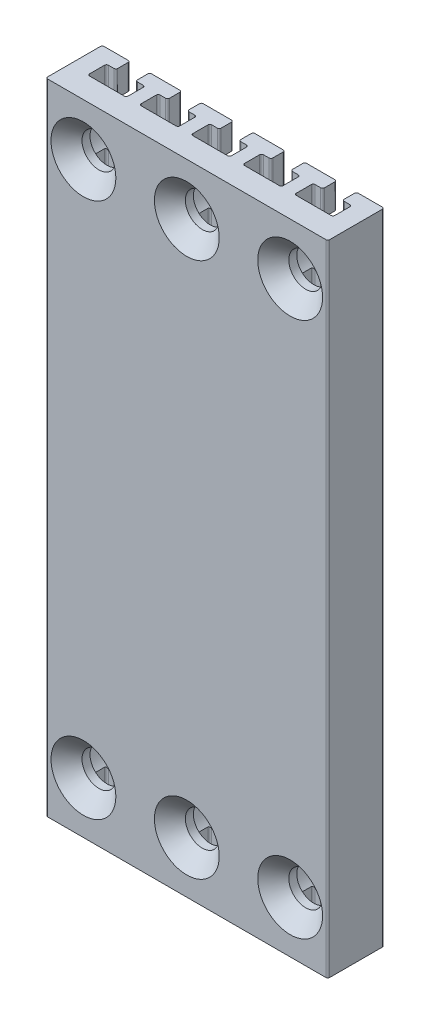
from build123d import *

# Parameters (mm, degrees)
BOSS_EXTRU_1_DEPTH                             = 68
CASSAGE_D_ANGLE_RAINURES_R                     = 0.2
CENTRAGE_RAPPELS_REACH                         = 71.893
ESQUISSE2_R                                    = 3
FRAISAGE_POUR_VIS_T_TE_FRAIS_E_M33_D           = 3.6
FRAISAGE_POUR_VIS_T_TE_FRAIS_E_M33_CSINK_D     = 6.9
FRAISAGE_POUR_VIS_T_TE_FRAIS_E_M33_CSINK_ANGLE = 90
R_P_TITION_LIN_AIRE1_COUNT                     = 3
R_P_TITION_LIN_AIRE1_PITCH                     = 11
R_P_TITION_LIN_AIRE1_COUNT_DIR2                = 2
R_P_TITION_LIN_AIRE1_PITCH_DIR2                = 57


with BuildPart() as part:
    # Esquisse1 → Boss.-Extru.1 (new body)
    with BuildSketch(Plane(origin=(0, 0, 0), x_dir=(1, 0, 0), z_dir=(0, 1, 0))):
        Polygon((-15, 6), (-12.05, 6), (-12.05, 4.5), (-13.05, 4.5), (-13.05, 2.5), (-8.95, 2.5), (-8.95, 4.5), (-9.95, 4.5), (-9.95, 6), (-6.55, 6), (-6.55, 4.5), (-7.55, 4.5), (-7.55, 2.5), (-3.45, 2.5), (-3.45, 4.5), (-4.45, 4.5), (-4.45, 6), (-1.05, 6), (-1.05, 4.5), (-2.05, 4.5), (-2.05, 2.5), (2.05, 2.5), (2.05, 4.5), (1.05, 4.5), (1.05, 6), (4.45, 6), (4.45, 4.5), (3.45, 4.5), (3.45, 2.5), (7.55, 2.5), (7.55, 4.5), (6.55, 4.5), (6.55, 6), (9.95, 6), (9.95, 4.5), (8.95, 4.5), (8.95, 2.5), (13.05, 2.5), (13.05, 4.5), (12.05, 4.5), (12.05, 6), (15, 6), (15, 0), (-15, 0), align=None)
    extrude(amount=BOSS_EXTRU_1_DEPTH)

    # Cassage d_angle rainures
    cassage_d_angle_rainures_edges = [part.edges().sort_by_distance(p)[0] for p in [
        (-15, 34, -6),
        (-12.05, 34, -6),
        (-12.05, 34, -4.5),
        (-13.05, 34, -4.5),
        (-13.05, 34, -2.5),
        (-8.95, 34, -2.5),
        (-8.95, 34, -4.5),
        (-9.95, 34, -4.5),
        (-9.95, 34, -6),
        (-6.55, 34, -6),
        (-6.55, 34, -4.5),
        (-7.55, 34, -4.5),
        (-7.55, 34, -2.5),
        (-3.45, 34, -2.5),
        (-3.45, 34, -4.5),
        (-4.45, 34, -4.5),
        (-4.45, 34, -6),
        (-1.05, 34, -6),
        (-1.05, 34, -4.5),
        (-2.05, 34, -4.5),
        (-2.05, 34, -2.5),
        (2.05, 34, -2.5),
        (2.05, 34, -4.5),
        (1.05, 34, -4.5),
        (1.05, 34, -6),
        (4.45, 34, -6),
        (4.45, 34, -4.5),
        (3.45, 34, -4.5),
        (3.45, 34, -2.5),
        (7.55, 34, -2.5),
        (7.55, 34, -4.5),
        (6.55, 34, -4.5),
        (6.55, 34, -6),
        (9.95, 34, -6),
        (9.95, 34, -4.5),
        (8.95, 34, -4.5),
        (8.95, 34, -2.5),
        (13.05, 34, -2.5),
        (13.05, 34, -4.5),
        (12.05, 34, -4.5),
        (12.05, 34, -6),
        (15, 34, -6),
        (15, 34, 0),
        (-15, 34, 0),
    ]]
    fillet(cassage_d_angle_rainures_edges, radius=CASSAGE_D_ANGLE_RAINURES_R)

    # centrage rappels: up to this face of the body (flat: up to its plane)
    centrage_rappels_end = Plane(part.part.faces().sort_by_distance((5.5, 34, -2.5))[0])
    # Esquisse2 → centrage rappels (cut, up to the picked face)
    with BuildSketch(Plane(origin=(0, 0, -6), x_dir=(-1, 0, 0), z_dir=(0, 0, -1)), mode=Mode.PRIVATE) as centrage_rappels_sk1:
        with Locations((-11, 62.5)):
            Circle(ESQUISSE2_R)
    centrage_rappels_tool1 = split(extrude(centrage_rappels_sk1.sketch, amount=-CENTRAGE_RAPPELS_REACH, mode=Mode.PRIVATE), bisect_by=centrage_rappels_end, keep=Keep.BOTH, mode=Mode.PRIVATE)
    # Esquisse2 → centrage rappels (cut, up to the picked face)
    with BuildSketch(Plane(origin=(0, 0, -6), x_dir=(-1, 0, 0), z_dir=(0, 0, -1)), mode=Mode.PRIVATE) as centrage_rappels_sk2:
        with Locations((0, 62.5)):
            Circle(ESQUISSE2_R)
    centrage_rappels_tool2 = split(extrude(centrage_rappels_sk2.sketch, amount=-CENTRAGE_RAPPELS_REACH, mode=Mode.PRIVATE), bisect_by=centrage_rappels_end, keep=Keep.BOTH, mode=Mode.PRIVATE)
    # Esquisse2 → centrage rappels (cut, up to the picked face)
    with BuildSketch(Plane(origin=(0, 0, -6), x_dir=(-1, 0, 0), z_dir=(0, 0, -1)), mode=Mode.PRIVATE) as centrage_rappels_sk3:
        with Locations((11, 62.5)):
            Circle(ESQUISSE2_R)
    centrage_rappels_tool3 = split(extrude(centrage_rappels_sk3.sketch, amount=-CENTRAGE_RAPPELS_REACH, mode=Mode.PRIVATE), bisect_by=centrage_rappels_end, keep=Keep.BOTH, mode=Mode.PRIVATE)
    # Esquisse2 → centrage rappels (cut, up to the picked face)
    with BuildSketch(Plane(origin=(0, 0, -6), x_dir=(-1, 0, 0), z_dir=(0, 0, -1)), mode=Mode.PRIVATE) as centrage_rappels_sk4:
        with Locations((0, 5.5)):
            Circle(ESQUISSE2_R)
    centrage_rappels_tool4 = split(extrude(centrage_rappels_sk4.sketch, amount=-CENTRAGE_RAPPELS_REACH, mode=Mode.PRIVATE), bisect_by=centrage_rappels_end, keep=Keep.BOTH, mode=Mode.PRIVATE)
    # Esquisse2 → centrage rappels (cut, up to the picked face)
    with BuildSketch(Plane(origin=(0, 0, -6), x_dir=(-1, 0, 0), z_dir=(0, 0, -1)), mode=Mode.PRIVATE) as centrage_rappels_sk5:
        with Locations((11, 5.5)):
            Circle(ESQUISSE2_R)
    centrage_rappels_tool5 = split(extrude(centrage_rappels_sk5.sketch, amount=-CENTRAGE_RAPPELS_REACH, mode=Mode.PRIVATE), bisect_by=centrage_rappels_end, keep=Keep.BOTH, mode=Mode.PRIVATE)
    # Esquisse2 → centrage rappels (cut, up to the picked face)
    with BuildSketch(Plane(origin=(0, 0, -6), x_dir=(-1, 0, 0), z_dir=(0, 0, -1)), mode=Mode.PRIVATE) as centrage_rappels_sk6:
        with Locations((-11, 5.5)):
            Circle(ESQUISSE2_R)
    centrage_rappels_tool6 = split(extrude(centrage_rappels_sk6.sketch, amount=-CENTRAGE_RAPPELS_REACH, mode=Mode.PRIVATE), bisect_by=centrage_rappels_end, keep=Keep.BOTH, mode=Mode.PRIVATE)
    add(centrage_rappels_tool1.solids().sort_by(Axis((11, 62.5, -6), (0, 0, 1)))[0], mode=Mode.SUBTRACT)
    add(centrage_rappels_tool2.solids().sort_by(Axis((0, 62.5, -6), (0, 0, 1)))[0], mode=Mode.SUBTRACT)
    add(centrage_rappels_tool3.solids().sort_by(Axis((-11, 62.5, -6), (0, 0, 1)))[0], mode=Mode.SUBTRACT)
    add(centrage_rappels_tool4.solids().sort_by(Axis((0, 5.5, -6), (0, 0, 1)))[0], mode=Mode.SUBTRACT)
    add(centrage_rappels_tool5.solids().sort_by(Axis((-11, 5.5, -6), (0, 0, 1)))[0], mode=Mode.SUBTRACT)
    add(centrage_rappels_tool6.solids().sort_by(Axis((11, 5.5, -6), (0, 0, 1)))[0], mode=Mode.SUBTRACT)

    # Fraisage pour vis _ t_te frais_e M33 (through all)
    with Locations(Plane.XY):
        with Locations((-11, 62.5)):
            fraisage_pour_vis_t_te_frais_e_m33 = CounterSinkHole(FRAISAGE_POUR_VIS_T_TE_FRAIS_E_M33_D / 2, FRAISAGE_POUR_VIS_T_TE_FRAIS_E_M33_CSINK_D / 2, counter_sink_angle=FRAISAGE_POUR_VIS_T_TE_FRAIS_E_M33_CSINK_ANGLE)

    # R_p_tition lin_aire1: Fraisage pour vis _ t_te frais_e M33 3 × 2
    with Locations(*[(i * R_P_TITION_LIN_AIRE1_PITCH, -j * R_P_TITION_LIN_AIRE1_PITCH_DIR2, 0) for i in range(R_P_TITION_LIN_AIRE1_COUNT) for j in range(R_P_TITION_LIN_AIRE1_COUNT_DIR2) if (i, j) != (0, 0)]):
        add(fraisage_pour_vis_t_te_frais_e_m33, mode=Mode.SUBTRACT)


solid = part.part
